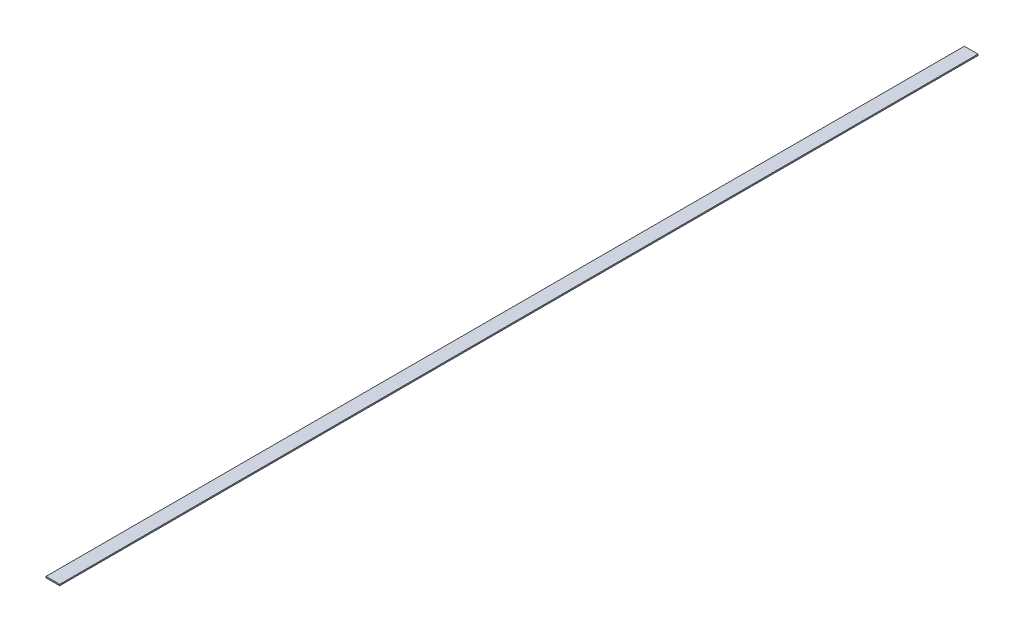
ISO-10303-21;
HEADER;
FILE_DESCRIPTION(('STEP AP214'),'2;1');
FILE_NAME('part.step','',(''),(''),'','','');
FILE_SCHEMA(('AUTOMOTIVE_DESIGN { 1 0 10303 214 1 1 1 1 }'));
ENDSEC;
DATA;
#1=APPLICATION_CONTEXT('core data for automotive mechanical design processes');
#2=APPLICATION_PROTOCOL_DEFINITION('international standard','automotive_design',2000,#1);
#3=PRODUCT_CONTEXT('',#1,'mechanical');
#4=PRODUCT('Part','Part','',(#3));
#5=PRODUCT_RELATED_PRODUCT_CATEGORY('part','',(#4));
#6=PRODUCT_DEFINITION_FORMATION('','',#4);
#7=PRODUCT_DEFINITION_CONTEXT('part definition',#1,'design');
#8=PRODUCT_DEFINITION('design','',#6,#7);
#9=PRODUCT_DEFINITION_SHAPE('','',#8);
#10=(LENGTH_UNIT() NAMED_UNIT(*) SI_UNIT(.MILLI.,.METRE.));
#11=(NAMED_UNIT(*) PLANE_ANGLE_UNIT() SI_UNIT($,.RADIAN.));
#12=(NAMED_UNIT(*) SI_UNIT($,.STERADIAN.) SOLID_ANGLE_UNIT());
#13=UNCERTAINTY_MEASURE_WITH_UNIT(LENGTH_MEASURE(1.E-05),#10,'distance_accuracy_value','');
#14=(GEOMETRIC_REPRESENTATION_CONTEXT(3) GLOBAL_UNCERTAINTY_ASSIGNED_CONTEXT((#13)) GLOBAL_UNIT_ASSIGNED_CONTEXT((#10,
#11,#12)) REPRESENTATION_CONTEXT('',''));
#15=CARTESIAN_POINT('',(0.,0.,0.));
#16=DIRECTION('',(0.,0.,1.));
#17=DIRECTION('',(1.,0.,0.));
#18=AXIS2_PLACEMENT_3D('',#15,#16,#17);
#19=CARTESIAN_POINT('',(-44.4152323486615,29.4091029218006,3403.6));
#20=DIRECTION('',(-1.,0.,0.));
#21=DIRECTION('',(0.,0.,1.));
#22=AXIS2_PLACEMENT_3D('',#19,#20,#21);
#23=PLANE('',#22);
#24=DIRECTION('',(0.,0.,-1.));
#25=VECTOR('',#24,1.);
#26=CARTESIAN_POINT('',(-44.4152323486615,24.6466029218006,3403.6));
#27=LINE('',#26,#25);
#28=CARTESIAN_POINT('',(-44.4152323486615,24.6466029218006,3403.6));
#29=VERTEX_POINT('',#28);
#30=CARTESIAN_POINT('',(-44.4152323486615,24.6466029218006,0.));
#31=VERTEX_POINT('',#30);
#32=EDGE_CURVE('E95',#29,#31,#27,.T.);
#33=ORIENTED_EDGE('',*,*,#32,.F.);
#34=DIRECTION('',(0.,-1.,0.));
#35=VECTOR('',#34,1.);
#36=CARTESIAN_POINT('',(-44.4152323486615,29.4091029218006,3403.6));
#37=LINE('',#36,#35);
#38=CARTESIAN_POINT('',(-44.4152323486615,29.4091029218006,3403.6));
#39=VERTEX_POINT('',#38);
#40=EDGE_CURVE('E11',#39,#29,#37,.T.);
#41=ORIENTED_EDGE('',*,*,#40,.F.);
#42=DIRECTION('',(0.,0.,-1.));
#43=VECTOR('',#42,1.);
#44=CARTESIAN_POINT('',(-44.4152323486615,29.4091029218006,3403.6));
#45=LINE('',#44,#43);
#46=CARTESIAN_POINT('',(-44.4152323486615,29.4091029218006,0.));
#47=VERTEX_POINT('',#46);
#48=EDGE_CURVE('E89',#39,#47,#45,.T.);
#49=ORIENTED_EDGE('',*,*,#48,.T.);
#50=DIRECTION('',(0.,-1.,0.));
#51=VECTOR('',#50,1.);
#52=CARTESIAN_POINT('',(-44.4152323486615,29.4091029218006,0.));
#53=LINE('',#52,#51);
#54=EDGE_CURVE('E34',#47,#31,#53,.T.);
#55=ORIENTED_EDGE('',*,*,#54,.T.);
#56=EDGE_LOOP('',(#33,#41,#49,#55));
#57=FACE_BOUND('',#56,.T.);
#58=ADVANCED_FACE('F31',(#57),#23,.T.);
#59=CARTESIAN_POINT('',(6.38476765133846,29.4091029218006,3403.6));
#60=DIRECTION('',(0.,0.,1.));
#61=DIRECTION('',(1.,0.,0.));
#62=AXIS2_PLACEMENT_3D('',#59,#60,#61);
#63=PLANE('',#62);
#64=DIRECTION('',(-1.,0.,0.));
#65=VECTOR('',#64,1.);
#66=CARTESIAN_POINT('',(6.38476765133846,24.6466029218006,3403.6));
#67=LINE('',#66,#65);
#68=CARTESIAN_POINT('',(6.38476765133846,24.6466029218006,3403.6));
#69=VERTEX_POINT('',#68);
#70=EDGE_CURVE('E91',#69,#29,#67,.T.);
#71=ORIENTED_EDGE('',*,*,#70,.F.);
#72=DIRECTION('',(0.,-1.,0.));
#73=VECTOR('',#72,1.);
#74=CARTESIAN_POINT('',(6.38476765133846,29.4091029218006,3403.6));
#75=LINE('',#74,#73);
#76=CARTESIAN_POINT('',(6.38476765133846,29.4091029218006,3403.6));
#77=VERTEX_POINT('',#76);
#78=EDGE_CURVE('E40',#77,#69,#75,.T.);
#79=ORIENTED_EDGE('',*,*,#78,.F.);
#80=DIRECTION('',(-1.,0.,0.));
#81=VECTOR('',#80,1.);
#82=CARTESIAN_POINT('',(6.38476765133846,29.4091029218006,3403.6));
#83=LINE('',#82,#81);
#84=EDGE_CURVE('E86',#77,#39,#83,.T.);
#85=ORIENTED_EDGE('',*,*,#84,.T.);
#86=ORIENTED_EDGE('',*,*,#40,.T.);
#87=EDGE_LOOP('',(#71,#79,#85,#86));
#88=FACE_BOUND('',#87,.T.);
#89=ADVANCED_FACE('F105',(#88),#63,.T.);
#90=CARTESIAN_POINT('',(6.38476765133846,29.4091029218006,0.));
#91=DIRECTION('',(1.,0.,0.));
#92=DIRECTION('',(0.,0.,-1.));
#93=AXIS2_PLACEMENT_3D('',#90,#91,#92);
#94=PLANE('',#93);
#95=DIRECTION('',(0.,0.,1.));
#96=VECTOR('',#95,1.);
#97=CARTESIAN_POINT('',(6.38476765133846,24.6466029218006,0.));
#98=LINE('',#97,#96);
#99=CARTESIAN_POINT('',(6.38476765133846,24.6466029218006,0.));
#100=VERTEX_POINT('',#99);
#101=EDGE_CURVE('E81',#100,#69,#98,.T.);
#102=ORIENTED_EDGE('',*,*,#101,.F.);
#103=DIRECTION('',(0.,-1.,0.));
#104=VECTOR('',#103,1.);
#105=CARTESIAN_POINT('',(6.38476765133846,29.4091029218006,0.));
#106=LINE('',#105,#104);
#107=CARTESIAN_POINT('',(6.38476765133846,29.4091029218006,0.));
#108=VERTEX_POINT('',#107);
#109=EDGE_CURVE('E76',#108,#100,#106,.T.);
#110=ORIENTED_EDGE('',*,*,#109,.F.);
#111=DIRECTION('',(0.,0.,1.));
#112=VECTOR('',#111,1.);
#113=CARTESIAN_POINT('',(6.38476765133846,29.4091029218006,0.));
#114=LINE('',#113,#112);
#115=EDGE_CURVE('E79',#108,#77,#114,.T.);
#116=ORIENTED_EDGE('',*,*,#115,.T.);
#117=ORIENTED_EDGE('',*,*,#78,.T.);
#118=EDGE_LOOP('',(#102,#110,#116,#117));
#119=FACE_BOUND('',#118,.T.);
#120=ADVANCED_FACE('F78',(#119),#94,.T.);
#121=CARTESIAN_POINT('',(-44.4152323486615,29.4091029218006,0.));
#122=DIRECTION('',(0.,0.,-1.));
#123=DIRECTION('',(-1.,0.,0.));
#124=AXIS2_PLACEMENT_3D('',#121,#122,#123);
#125=PLANE('',#124);
#126=DIRECTION('',(1.,0.,0.));
#127=VECTOR('',#126,1.);
#128=CARTESIAN_POINT('',(-44.4152323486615,24.6466029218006,0.));
#129=LINE('',#128,#127);
#130=EDGE_CURVE('E98',#31,#100,#129,.T.);
#131=ORIENTED_EDGE('',*,*,#130,.F.);
#132=ORIENTED_EDGE('',*,*,#54,.F.);
#133=DIRECTION('',(1.,0.,0.));
#134=VECTOR('',#133,1.);
#135=CARTESIAN_POINT('',(-44.4152323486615,29.4091029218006,0.));
#136=LINE('',#135,#134);
#137=EDGE_CURVE('E85',#47,#108,#136,.T.);
#138=ORIENTED_EDGE('',*,*,#137,.T.);
#139=ORIENTED_EDGE('',*,*,#109,.T.);
#140=EDGE_LOOP('',(#131,#132,#138,#139));
#141=FACE_BOUND('',#140,.T.);
#142=ADVANCED_FACE('F88',(#141),#125,.T.);
#143=CARTESIAN_POINT('',(-44.4152323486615,29.4091029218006,0.));
#144=DIRECTION('',(0.,-1.,0.));
#145=DIRECTION('',(0.,0.,-1.));
#146=AXIS2_PLACEMENT_3D('',#143,#144,#145);
#147=PLANE('',#146);
#148=ORIENTED_EDGE('',*,*,#48,.F.);
#149=ORIENTED_EDGE('',*,*,#84,.F.);
#150=ORIENTED_EDGE('',*,*,#115,.F.);
#151=ORIENTED_EDGE('',*,*,#137,.F.);
#152=EDGE_LOOP('',(#148,#149,#150,#151));
#153=FACE_BOUND('',#152,.T.);
#154=ADVANCED_FACE('F84',(#153),#147,.F.);
#155=CARTESIAN_POINT('',(-44.4152323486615,24.6466029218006,0.));
#156=DIRECTION('',(0.,-1.,0.));
#157=DIRECTION('',(0.,0.,-1.));
#158=AXIS2_PLACEMENT_3D('',#155,#156,#157);
#159=PLANE('',#158);
#160=ORIENTED_EDGE('',*,*,#32,.T.);
#161=ORIENTED_EDGE('',*,*,#130,.T.);
#162=ORIENTED_EDGE('',*,*,#101,.T.);
#163=ORIENTED_EDGE('',*,*,#70,.T.);
#164=EDGE_LOOP('',(#160,#161,#162,#163));
#165=FACE_BOUND('',#164,.T.);
#166=ADVANCED_FACE('F104',(#165),#159,.T.);
#167=CLOSED_SHELL('',(#58,#89,#120,#142,#154,#166));
#168=MANIFOLD_SOLID_BREP('B2',#167);
#169=ADVANCED_BREP_SHAPE_REPRESENTATION('',(#18,#168),#14);
#170=SHAPE_DEFINITION_REPRESENTATION(#9,#169);
ENDSEC;
END-ISO-10303-21;
